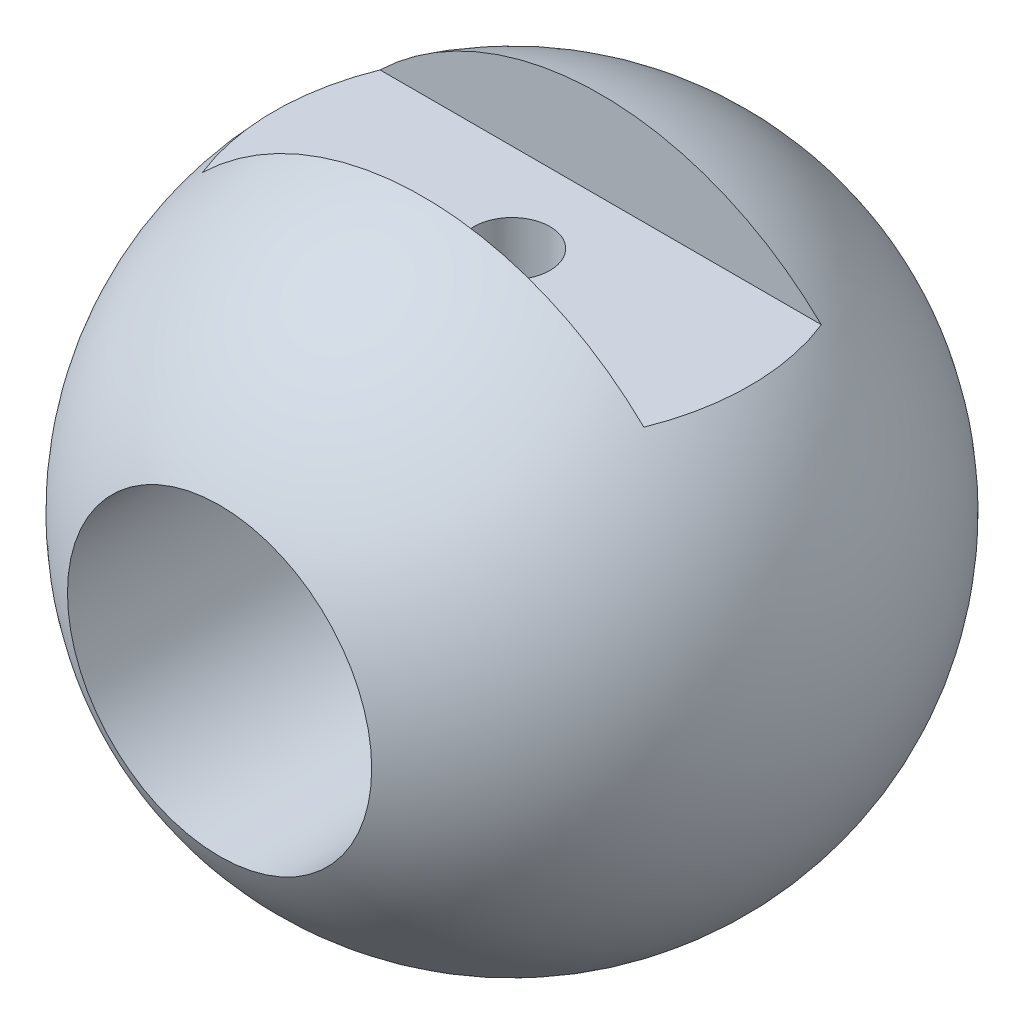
ISO-10303-21;
HEADER;
FILE_DESCRIPTION(('STEP AP214'),'2;1');
FILE_NAME('part.step','',(''),(''),'','','');
FILE_SCHEMA(('AUTOMOTIVE_DESIGN { 1 0 10303 214 1 1 1 1 }'));
ENDSEC;
DATA;
#1=APPLICATION_CONTEXT('core data for automotive mechanical design processes');
#2=APPLICATION_PROTOCOL_DEFINITION('international standard','automotive_design',2000,#1);
#3=PRODUCT_CONTEXT('',#1,'mechanical');
#4=PRODUCT('Part','Part','',(#3));
#5=PRODUCT_RELATED_PRODUCT_CATEGORY('part','',(#4));
#6=PRODUCT_DEFINITION_FORMATION('','',#4);
#7=PRODUCT_DEFINITION_CONTEXT('part definition',#1,'design');
#8=PRODUCT_DEFINITION('design','',#6,#7);
#9=PRODUCT_DEFINITION_SHAPE('','',#8);
#10=(LENGTH_UNIT() NAMED_UNIT(*) SI_UNIT(.MILLI.,.METRE.));
#11=(NAMED_UNIT(*) PLANE_ANGLE_UNIT() SI_UNIT($,.RADIAN.));
#12=(NAMED_UNIT(*) SI_UNIT($,.STERADIAN.) SOLID_ANGLE_UNIT());
#13=UNCERTAINTY_MEASURE_WITH_UNIT(LENGTH_MEASURE(1.E-05),#10,'distance_accuracy_value','');
#14=(GEOMETRIC_REPRESENTATION_CONTEXT(3) GLOBAL_UNCERTAINTY_ASSIGNED_CONTEXT((#13)) GLOBAL_UNIT_ASSIGNED_CONTEXT((#10,
#11,#12)) REPRESENTATION_CONTEXT('',''));
#15=CARTESIAN_POINT('',(0.,0.,0.));
#16=DIRECTION('',(0.,0.,1.));
#17=DIRECTION('',(1.,0.,0.));
#18=AXIS2_PLACEMENT_3D('',#15,#16,#17);
#19=CARTESIAN_POINT('',(0.,0.,0.));
#20=DIRECTION('',(0.,0.,1.));
#21=DIRECTION('',(1.,0.,0.));
#22=AXIS2_PLACEMENT_3D('',#19,#20,#21);
#23=SPHERICAL_SURFACE('',#22,13.);
#24=CARTESIAN_POINT('',(0.,0.,11.5325625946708));
#25=DIRECTION('',(0.,0.,-1.));
#26=DIRECTION('',(-1.,0.,0.));
#27=AXIS2_PLACEMENT_3D('',#24,#25,#26);
#28=CIRCLE('',#27,6.);
#29=CARTESIAN_POINT('',(-6.,0.,11.5325625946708));
#30=VERTEX_POINT('',#29);
#31=EDGE_CURVE('E68',#30,#30,#28,.T.);
#32=ORIENTED_EDGE('',*,*,#31,.T.);
#33=EDGE_LOOP('',(#32));
#34=FACE_BOUND('',#33,.T.);
#35=CARTESIAN_POINT('',(0.,0.,-11.5325625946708));
#36=DIRECTION('',(0.,0.,1.));
#37=DIRECTION('',(1.,0.,0.));
#38=AXIS2_PLACEMENT_3D('',#35,#36,#37);
#39=CIRCLE('',#38,6.);
#40=CARTESIAN_POINT('',(6.,0.,-11.5325625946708));
#41=VERTEX_POINT('',#40);
#42=EDGE_CURVE('E70',#41,#41,#39,.T.);
#43=ORIENTED_EDGE('',*,*,#42,.T.);
#44=EDGE_LOOP('',(#43));
#45=FACE_BOUND('',#44,.T.);
#46=CARTESIAN_POINT('',(0.,9.,0.));
#47=DIRECTION('',(0.,1.,0.));
#48=DIRECTION('',(0.,0.,1.));
#49=AXIS2_PLACEMENT_3D('',#46,#47,#48);
#50=CIRCLE('',#49,9.38083151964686);
#51=CARTESIAN_POINT('',(8.7034475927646,8.99999999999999,3.50000000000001));
#52=VERTEX_POINT('',#51);
#53=CARTESIAN_POINT('',(8.70344759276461,8.99999999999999,-3.5));
#54=VERTEX_POINT('',#53);
#55=EDGE_CURVE('E55',#52,#54,#50,.T.);
#56=ORIENTED_EDGE('',*,*,#55,.F.);
#57=CARTESIAN_POINT('',(0.,0.,3.50000000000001));
#58=DIRECTION('',(0.,0.,1.));
#59=DIRECTION('',(0.,-1.,0.));
#60=AXIS2_PLACEMENT_3D('',#57,#58,#59);
#61=CIRCLE('',#60,12.5199840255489);
#62=CARTESIAN_POINT('',(-8.70344759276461,8.99999999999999,3.50000000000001));
#63=VERTEX_POINT('',#62);
#64=EDGE_CURVE('E11',#52,#63,#61,.T.);
#65=ORIENTED_EDGE('',*,*,#64,.T.);
#66=CARTESIAN_POINT('',(-8.70344759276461,8.99999999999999,-3.5));
#67=VERTEX_POINT('',#66);
#68=EDGE_CURVE('E61',#67,#63,#50,.T.);
#69=ORIENTED_EDGE('',*,*,#68,.F.);
#70=CARTESIAN_POINT('',(0.,0.,-3.50000000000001));
#71=DIRECTION('',(0.,0.,-1.));
#72=DIRECTION('',(-1.,0.,0.));
#73=AXIS2_PLACEMENT_3D('',#70,#71,#72);
#74=CIRCLE('',#73,12.5199840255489);
#75=EDGE_CURVE('E37',#67,#54,#74,.T.);
#76=ORIENTED_EDGE('',*,*,#75,.T.);
#77=EDGE_LOOP('',(#56,#65,#69,#76));
#78=FACE_BOUND('',#77,.T.);
#79=ADVANCED_FACE('F30',(#34,#45,#78),#23,.T.);
#80=CARTESIAN_POINT('',(0.,20.,0.));
#81=DIRECTION('',(0.,-1.,0.));
#82=DIRECTION('',(0.,0.,-1.));
#83=AXIS2_PLACEMENT_3D('',#80,#81,#82);
#84=CYLINDRICAL_SURFACE('',#83,1.5);
#85=CARTESIAN_POINT('',(0.,6.,-1.49999999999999));
#86=CARTESIAN_POINT('',(0.0828760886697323,5.99999859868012,-1.49999767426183));
#87=CARTESIAN_POINT('',(0.165778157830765,5.99826578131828,-1.49310844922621));
#88=CARTESIAN_POINT('',(0.329206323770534,5.99152113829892,-1.465774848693));
#89=CARTESIAN_POINT('',(0.409731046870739,5.98650745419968,-1.44532279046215));
#90=CARTESIAN_POINT('',(0.566020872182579,5.9737562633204,-1.39156074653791));
#91=CARTESIAN_POINT('',(0.641791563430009,5.96602202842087,-1.35826620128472));
#92=CARTESIAN_POINT('',(0.786672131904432,5.94865343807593,-1.27981860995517));
#93=CARTESIAN_POINT('',(0.85578178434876,5.9390190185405,-1.23466516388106));
#94=CARTESIAN_POINT('',(0.986801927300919,5.91867413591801,-1.13279921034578));
#95=CARTESIAN_POINT('',(1.04855569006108,5.90794707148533,-1.07588842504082));
#96=CARTESIAN_POINT('',(1.16174892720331,5.8867362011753,-0.952547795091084));
#97=CARTESIAN_POINT('',(1.21318723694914,5.87625242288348,-0.886116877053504));
#98=CARTESIAN_POINT('',(1.30502654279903,5.8565477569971,-0.744404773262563));
#99=CARTESIAN_POINT('',(1.34525221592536,5.84734794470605,-0.669006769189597));
#100=CARTESIAN_POINT('',(1.41239690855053,5.83149494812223,-0.512251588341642));
#101=CARTESIAN_POINT('',(1.43931805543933,5.82484135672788,-0.430895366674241));
#102=CARTESIAN_POINT('',(1.47855483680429,5.8150047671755,-0.266256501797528));
#103=CARTESIAN_POINT('',(1.49115226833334,5.81175491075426,-0.183045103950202));
#104=CARTESIAN_POINT('',(1.50226177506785,5.80889362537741,-0.0156314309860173));
#105=CARTESIAN_POINT('',(1.50077614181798,5.80928160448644,0.0685706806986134));
#106=CARTESIAN_POINT('',(1.48398652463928,5.81359205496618,0.233415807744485));
#107=CARTESIAN_POINT('',(1.46901834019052,5.8174286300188,0.314095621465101));
#108=CARTESIAN_POINT('',(1.4262241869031,5.82806709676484,0.471761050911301));
#109=CARTESIAN_POINT('',(1.39839730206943,5.83486919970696,0.548746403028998));
#110=CARTESIAN_POINT('',(1.33038947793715,5.85075113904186,0.697738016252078));
#111=CARTESIAN_POINT('',(1.2900866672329,5.85985327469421,0.769686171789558));
#112=CARTESIAN_POINT('',(1.19835627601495,5.87929710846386,0.905918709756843));
#113=CARTESIAN_POINT('',(1.14692674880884,5.88963902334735,0.970201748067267));
#114=CARTESIAN_POINT('',(1.03266342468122,5.9107588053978,1.09120361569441));
#115=CARTESIAN_POINT('',(0.969546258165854,5.92154069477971,1.14765449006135));
#116=CARTESIAN_POINT('',(0.834611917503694,5.94205965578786,1.24922124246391));
#117=CARTESIAN_POINT('',(0.762794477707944,5.95179669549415,1.29433677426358));
#118=CARTESIAN_POINT('',(0.612115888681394,5.96917732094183,1.3720505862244));
#119=CARTESIAN_POINT('',(0.533231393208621,5.97681360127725,1.40460534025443));
#120=CARTESIAN_POINT('',(0.370876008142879,5.98907916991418,1.45591730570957));
#121=CARTESIAN_POINT('',(0.287405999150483,5.9937090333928,1.47467715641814));
#122=CARTESIAN_POINT('',(0.120539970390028,5.99935499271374,1.49745756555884));
#123=CARTESIAN_POINT('',(0.0371967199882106,6.00046053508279,1.5018430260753));
#124=CARTESIAN_POINT('',(-0.129032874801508,5.99918804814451,1.49675099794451));
#125=CARTESIAN_POINT('',(-0.211919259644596,5.99681033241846,1.48727475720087));
#126=CARTESIAN_POINT('',(-0.373614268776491,5.98889581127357,1.45502909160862));
#127=CARTESIAN_POINT('',(-0.452465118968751,5.98340634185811,1.43245873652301));
#128=CARTESIAN_POINT('',(-0.605257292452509,5.96988706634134,1.37489291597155));
#129=CARTESIAN_POINT('',(-0.679198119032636,5.96185700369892,1.33989619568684));
#130=CARTESIAN_POINT('',(-0.821523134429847,5.9439330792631,1.25776387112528));
#131=CARTESIAN_POINT('',(-0.889785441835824,5.93400867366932,1.21042388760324));
#132=CARTESIAN_POINT('',(-1.01752661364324,5.91344509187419,1.10521009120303));
#133=CARTESIAN_POINT('',(-1.07700395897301,5.90280579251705,1.0473344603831));
#134=CARTESIAN_POINT('',(-1.18699056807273,5.88168956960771,0.920998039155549));
#135=CARTESIAN_POINT('',(-1.23724386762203,5.87122304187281,0.852312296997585));
#136=CARTESIAN_POINT('',(-1.32551075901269,5.85192878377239,0.707267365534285));
#137=CARTESIAN_POINT('',(-1.36352489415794,5.84310098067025,0.630908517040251));
#138=CARTESIAN_POINT('',(-1.42595142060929,5.82818094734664,0.473094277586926));
#139=CARTESIAN_POINT('',(-1.45044439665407,5.82207255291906,0.391672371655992));
#140=CARTESIAN_POINT('',(-1.48534565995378,5.81326744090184,0.225690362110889));
#141=CARTESIAN_POINT('',(-1.49575702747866,5.81056997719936,0.141130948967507));
#142=CARTESIAN_POINT('',(-1.502038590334,5.80894901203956,-0.0261210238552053));
#143=CARTESIAN_POINT('',(-1.49831789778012,5.80991932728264,-0.108797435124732));
#144=CARTESIAN_POINT('',(-1.47737727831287,5.81527909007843,-0.272303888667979));
#145=CARTESIAN_POINT('',(-1.46015762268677,5.81966846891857,-0.353133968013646));
#146=CARTESIAN_POINT('',(-1.4129313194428,5.83131260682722,-0.510208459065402));
#147=CARTESIAN_POINT('',(-1.38300140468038,5.83855015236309,-0.586477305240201));
#148=CARTESIAN_POINT('',(-1.31126491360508,5.85507755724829,-0.732965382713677));
#149=CARTESIAN_POINT('',(-1.26945669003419,5.86436770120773,-0.803183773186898));
#150=CARTESIAN_POINT('',(-1.17386774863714,5.88425634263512,-0.937554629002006));
#151=CARTESIAN_POINT('',(-1.11980316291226,5.89488264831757,-1.00150107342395));
#152=CARTESIAN_POINT('',(-1.00178937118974,5.91608027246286,-1.11954704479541));
#153=CARTESIAN_POINT('',(-0.937837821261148,5.92665157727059,-1.17364423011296));
#154=CARTESIAN_POINT('',(-0.800467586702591,5.94677655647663,-1.2714113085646));
#155=CARTESIAN_POINT('',(-0.726898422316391,5.95630833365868,-1.31487461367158));
#156=CARTESIAN_POINT('',(-0.573266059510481,5.97304924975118,-1.38874746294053));
#157=CARTESIAN_POINT('',(-0.49320756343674,5.98026005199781,-1.41916636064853));
#158=CARTESIAN_POINT('',(-0.344410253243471,5.99048059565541,-1.46157183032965));
#159=CARTESIAN_POINT('',(-0.276380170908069,5.99402585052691,-1.47595124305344));
#160=CARTESIAN_POINT('',(-0.138906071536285,5.99878605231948,-1.49516594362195));
#161=CARTESIAN_POINT('',(-0.069462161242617,6.00000117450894,-1.5000019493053));
#162=CARTESIAN_POINT('',(0.,6.,-1.49999999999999));
#163=B_SPLINE_CURVE_WITH_KNOTS('',3,(#85,#86,#87,#88,#89,#90,#91,#92,#93,#94,#95,#96,#97,#98,
#99,#100,#101,#102,#103,#104,#105,#106,#107,#108,#109,#110,#111,#112,#113,#114,#115,#116,#117,
#118,#119,#120,#121,#122,#123,#124,#125,#126,#127,#128,#129,#130,#131,#132,#133,#134,#135,#136,
#137,#138,#139,#140,#141,#142,#143,#144,#145,#146,#147,#148,#149,#150,#151,#152,#153,#154,#155,
#156,#157,#158,#159,#160,#161,#162),.UNSPECIFIED.,.T.,.F.,(4,2,2,2,2,2,2,2,2,2,2,2,2,2,2,2,2,2,
2,2,2,2,2,2,2,2,2,2,2,2,2,2,2,2,2,2,2,2,4),(0.,0.248373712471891,0.496888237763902,
0.74510490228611,0.993329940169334,1.24614435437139,1.49898729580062,1.75558647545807,
2.01214461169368,2.2635629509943,2.51494038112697,2.76022497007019,3.0055270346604,
3.2533052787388,3.50112690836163,3.7560150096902,4.01091089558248,4.26668229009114,
4.52240473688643,4.77158308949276,5.02073901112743,5.26620274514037,5.5116912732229,
5.76153587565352,6.01142363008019,6.26744509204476,6.52345518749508,6.77792254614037,
7.03233423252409,7.27943780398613,7.52653640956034,7.77216400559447,8.017825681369,
8.2698957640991,8.52202569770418,8.77872185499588,9.0352336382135,9.24342242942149,
9.4515955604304),.UNSPECIFIED.);
#164=CARTESIAN_POINT('',(0.,6.,-1.49999999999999));
#165=VERTEX_POINT('',#164);
#166=EDGE_CURVE('E60',#165,#165,#163,.T.);
#167=ORIENTED_EDGE('',*,*,#166,.T.);
#168=EDGE_LOOP('',(#167));
#169=FACE_BOUND('',#168,.T.);
#170=CARTESIAN_POINT('',(0.,9.,0.));
#171=DIRECTION('',(0.,1.,0.));
#172=DIRECTION('',(0.,0.,1.));
#173=AXIS2_PLACEMENT_3D('',#170,#171,#172);
#174=CIRCLE('',#173,1.5);
#175=CARTESIAN_POINT('',(0.,9.,1.50000000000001));
#176=VERTEX_POINT('',#175);
#177=EDGE_CURVE('E66',#176,#176,#174,.T.);
#178=ORIENTED_EDGE('',*,*,#177,.T.);
#179=EDGE_LOOP('',(#178));
#180=FACE_BOUND('',#179,.T.);
#181=ADVANCED_FACE('F82',(#169,#180),#84,.F.);
#182=CARTESIAN_POINT('',(0.,0.,-40.0000000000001));
#183=DIRECTION('',(0.,0.,1.));
#184=DIRECTION('',(1.,0.,0.));
#185=AXIS2_PLACEMENT_3D('',#182,#183,#184);
#186=CYLINDRICAL_SURFACE('',#185,6.);
#187=ORIENTED_EDGE('',*,*,#31,.F.);
#188=EDGE_LOOP('',(#187));
#189=FACE_BOUND('',#188,.T.);
#190=ORIENTED_EDGE('',*,*,#42,.F.);
#191=EDGE_LOOP('',(#190));
#192=FACE_BOUND('',#191,.T.);
#193=ORIENTED_EDGE('',*,*,#166,.F.);
#194=EDGE_LOOP('',(#193));
#195=FACE_BOUND('',#194,.T.);
#196=ADVANCED_FACE('F80',(#189,#192,#195),#186,.F.);
#197=CARTESIAN_POINT('',(-15.,13.,3.5));
#198=DIRECTION('',(0.,0.,1.));
#199=DIRECTION('',(0.,-1.,0.));
#200=AXIS2_PLACEMENT_3D('',#197,#198,#199);
#201=PLANE('',#200);
#202=DIRECTION('',(1.,0.,0.));
#203=VECTOR('',#202,1.);
#204=CARTESIAN_POINT('',(-15.,8.99999999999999,3.5));
#205=LINE('',#204,#203);
#206=EDGE_CURVE('E57',#63,#52,#205,.T.);
#207=ORIENTED_EDGE('',*,*,#206,.F.);
#208=ORIENTED_EDGE('',*,*,#64,.F.);
#209=EDGE_LOOP('',(#207,#208));
#210=FACE_BOUND('',#209,.T.);
#211=ADVANCED_FACE('F89',(#210),#201,.F.);
#212=CARTESIAN_POINT('',(-15.,8.99999999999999,-3.5));
#213=DIRECTION('',(0.,0.,-1.));
#214=DIRECTION('',(-1.,0.,0.));
#215=AXIS2_PLACEMENT_3D('',#212,#213,#214);
#216=PLANE('',#215);
#217=DIRECTION('',(1.,0.,0.));
#218=VECTOR('',#217,1.);
#219=CARTESIAN_POINT('',(-15.,8.99999999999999,-3.5));
#220=LINE('',#219,#218);
#221=EDGE_CURVE('E44',#67,#54,#220,.T.);
#222=ORIENTED_EDGE('',*,*,#221,.T.);
#223=ORIENTED_EDGE('',*,*,#75,.F.);
#224=EDGE_LOOP('',(#222,#223));
#225=FACE_BOUND('',#224,.T.);
#226=ADVANCED_FACE('F64',(#225),#216,.F.);
#227=CARTESIAN_POINT('',(-15.,8.99999999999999,-3.5));
#228=DIRECTION('',(0.,1.,0.));
#229=DIRECTION('',(0.,0.,1.));
#230=AXIS2_PLACEMENT_3D('',#227,#228,#229);
#231=PLANE('',#230);
#232=ORIENTED_EDGE('',*,*,#177,.F.);
#233=EDGE_LOOP('',(#232));
#234=FACE_BOUND('',#233,.T.);
#235=ORIENTED_EDGE('',*,*,#55,.T.);
#236=ORIENTED_EDGE('',*,*,#221,.F.);
#237=ORIENTED_EDGE('',*,*,#68,.T.);
#238=ORIENTED_EDGE('',*,*,#206,.T.);
#239=EDGE_LOOP('',(#235,#236,#237,#238));
#240=FACE_BOUND('',#239,.T.);
#241=ADVANCED_FACE('F56',(#234,#240),#231,.T.);
#242=CLOSED_SHELL('',(#79,#181,#196,#211,#226,#241));
#243=MANIFOLD_SOLID_BREP('B2',#242);
#244=ADVANCED_BREP_SHAPE_REPRESENTATION('',(#18,#243),#14);
#245=SHAPE_DEFINITION_REPRESENTATION(#9,#244);
ENDSEC;
END-ISO-10303-21;
